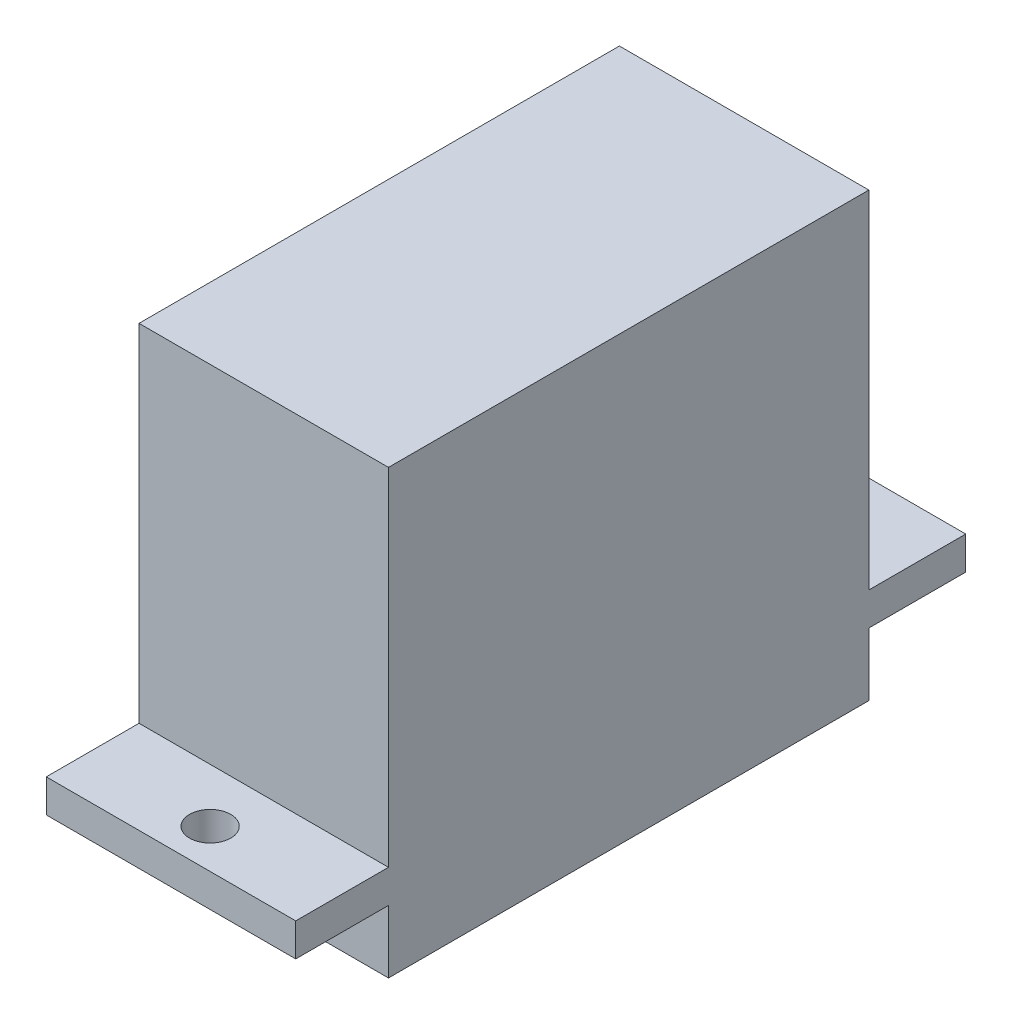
ISO-10303-21;
HEADER;
FILE_DESCRIPTION(('STEP AP214'),'2;1');
FILE_NAME('part.step','',(''),(''),'','','');
FILE_SCHEMA(('AUTOMOTIVE_DESIGN { 1 0 10303 214 1 1 1 1 }'));
ENDSEC;
DATA;
#1=APPLICATION_CONTEXT('core data for automotive mechanical design processes');
#2=APPLICATION_PROTOCOL_DEFINITION('international standard','automotive_design',2000,#1);
#3=PRODUCT_CONTEXT('',#1,'mechanical');
#4=PRODUCT('Part','Part','',(#3));
#5=PRODUCT_RELATED_PRODUCT_CATEGORY('part','',(#4));
#6=PRODUCT_DEFINITION_FORMATION('','',#4);
#7=PRODUCT_DEFINITION_CONTEXT('part definition',#1,'design');
#8=PRODUCT_DEFINITION('design','',#6,#7);
#9=PRODUCT_DEFINITION_SHAPE('','',#8);
#10=(LENGTH_UNIT() NAMED_UNIT(*) SI_UNIT(.MILLI.,.METRE.));
#11=(NAMED_UNIT(*) PLANE_ANGLE_UNIT() SI_UNIT($,.RADIAN.));
#12=(NAMED_UNIT(*) SI_UNIT($,.STERADIAN.) SOLID_ANGLE_UNIT());
#13=UNCERTAINTY_MEASURE_WITH_UNIT(LENGTH_MEASURE(1.E-05),#10,'distance_accuracy_value','');
#14=(GEOMETRIC_REPRESENTATION_CONTEXT(3) GLOBAL_UNCERTAINTY_ASSIGNED_CONTEXT((#13)) GLOBAL_UNIT_ASSIGNED_CONTEXT((#10,
#11,#12)) REPRESENTATION_CONTEXT('',''));
#15=CARTESIAN_POINT('',(0.,0.,0.));
#16=DIRECTION('',(0.,0.,1.));
#17=DIRECTION('',(1.,0.,0.));
#18=AXIS2_PLACEMENT_3D('',#15,#16,#17);
#19=CARTESIAN_POINT('',(6.05,-8.5159,16.8485));
#20=DIRECTION('',(0.,0.,-1.));
#21=DIRECTION('',(-1.,0.,0.));
#22=AXIS2_PLACEMENT_3D('',#19,#20,#21);
#23=PLANE('',#22);
#24=DIRECTION('',(-1.,0.,0.));
#25=VECTOR('',#24,1.);
#26=CARTESIAN_POINT('',(6.05,-5.46581,16.8485));
#27=LINE('',#26,#25);
#28=CARTESIAN_POINT('',(6.05,-5.46581,16.8485));
#29=VERTEX_POINT('',#28);
#30=CARTESIAN_POINT('',(-6.05,-5.46581,16.8485));
#31=VERTEX_POINT('',#30);
#32=EDGE_CURVE('E52',#29,#31,#27,.T.);
#33=ORIENTED_EDGE('',*,*,#32,.F.);
#34=DIRECTION('',(0.,-1.,0.));
#35=VECTOR('',#34,1.);
#36=CARTESIAN_POINT('',(6.05,-8.5159,16.8485));
#37=LINE('',#36,#35);
#38=CARTESIAN_POINT('',(6.05,-3.86581,16.8485));
#39=VERTEX_POINT('',#38);
#40=EDGE_CURVE('E167',#39,#29,#37,.T.);
#41=ORIENTED_EDGE('',*,*,#40,.F.);
#42=DIRECTION('',(-1.,0.,0.));
#43=VECTOR('',#42,1.);
#44=CARTESIAN_POINT('',(6.05,-3.86581,16.8485));
#45=LINE('',#44,#43);
#46=CARTESIAN_POINT('',(-6.05,-3.86581,16.8485));
#47=VERTEX_POINT('',#46);
#48=EDGE_CURVE('E225',#39,#47,#45,.T.);
#49=ORIENTED_EDGE('',*,*,#48,.T.);
#50=DIRECTION('',(0.,-1.,0.));
#51=VECTOR('',#50,1.);
#52=CARTESIAN_POINT('',(-6.05,-8.5159,16.8485));
#53=LINE('',#52,#51);
#54=EDGE_CURVE('E156',#47,#31,#53,.T.);
#55=ORIENTED_EDGE('',*,*,#54,.T.);
#56=EDGE_LOOP('',(#33,#41,#49,#55));
#57=FACE_BOUND('',#56,.T.);
#58=ADVANCED_FACE('F45',(#57),#23,.F.);
#59=CARTESIAN_POINT('',(6.05,-8.5159,-15.6515));
#60=DIRECTION('',(0.,0.,1.));
#61=DIRECTION('',(1.,0.,0.));
#62=AXIS2_PLACEMENT_3D('',#59,#60,#61);
#63=PLANE('',#62);
#64=DIRECTION('',(1.,0.,0.));
#65=VECTOR('',#64,1.);
#66=CARTESIAN_POINT('',(6.05,-5.46581,-15.6515));
#67=LINE('',#66,#65);
#68=CARTESIAN_POINT('',(-6.05,-5.46581,-15.6515));
#69=VERTEX_POINT('',#68);
#70=CARTESIAN_POINT('',(6.05,-5.46581,-15.6515));
#71=VERTEX_POINT('',#70);
#72=EDGE_CURVE('E170',#69,#71,#67,.T.);
#73=ORIENTED_EDGE('',*,*,#72,.F.);
#74=DIRECTION('',(0.,1.,0.));
#75=VECTOR('',#74,1.);
#76=CARTESIAN_POINT('',(-6.05,-8.5159,-15.6515));
#77=LINE('',#76,#75);
#78=CARTESIAN_POINT('',(-6.05,-3.86581,-15.6515));
#79=VERTEX_POINT('',#78);
#80=EDGE_CURVE('E155',#69,#79,#77,.T.);
#81=ORIENTED_EDGE('',*,*,#80,.T.);
#82=DIRECTION('',(1.,0.,0.));
#83=VECTOR('',#82,1.);
#84=CARTESIAN_POINT('',(6.05,-3.86581,-15.6515));
#85=LINE('',#84,#83);
#86=CARTESIAN_POINT('',(6.05,-3.86581,-15.6515));
#87=VERTEX_POINT('',#86);
#88=EDGE_CURVE('E161',#79,#87,#85,.T.);
#89=ORIENTED_EDGE('',*,*,#88,.T.);
#90=DIRECTION('',(0.,1.,0.));
#91=VECTOR('',#90,1.);
#92=CARTESIAN_POINT('',(6.05,-8.5159,-15.6515));
#93=LINE('',#92,#91);
#94=EDGE_CURVE('E246',#71,#87,#93,.T.);
#95=ORIENTED_EDGE('',*,*,#94,.F.);
#96=EDGE_LOOP('',(#73,#81,#89,#95));
#97=FACE_BOUND('',#96,.T.);
#98=ADVANCED_FACE('F291',(#97),#63,.F.);
#99=CARTESIAN_POINT('',(6.05,12.9341,16.8485));
#100=DIRECTION('',(0.,-1.,0.));
#101=DIRECTION('',(0.,0.,-1.));
#102=AXIS2_PLACEMENT_3D('',#99,#100,#101);
#103=PLANE('',#102);
#104=DIRECTION('',(1.,0.,0.));
#105=VECTOR('',#104,1.);
#106=CARTESIAN_POINT('',(-6.05,12.9341,-10.95155));
#107=LINE('',#106,#105);
#108=CARTESIAN_POINT('',(-6.05,12.9341,-10.95155));
#109=VERTEX_POINT('',#108);
#110=CARTESIAN_POINT('',(6.05,12.9341,-10.95155));
#111=VERTEX_POINT('',#110);
#112=EDGE_CURVE('E211',#109,#111,#107,.T.);
#113=ORIENTED_EDGE('',*,*,#112,.F.);
#114=DIRECTION('',(0.,0.,1.));
#115=VECTOR('',#114,1.);
#116=CARTESIAN_POINT('',(-6.05,12.9341,16.8485));
#117=LINE('',#116,#115);
#118=CARTESIAN_POINT('',(-6.05,12.9341,12.3484));
#119=VERTEX_POINT('',#118);
#120=EDGE_CURVE('E158',#109,#119,#117,.T.);
#121=ORIENTED_EDGE('',*,*,#120,.T.);
#122=DIRECTION('',(-1.,0.,0.));
#123=VECTOR('',#122,1.);
#124=CARTESIAN_POINT('',(-6.05,12.9341,12.3484));
#125=LINE('',#124,#123);
#126=CARTESIAN_POINT('',(6.05,12.9341,12.3484));
#127=VERTEX_POINT('',#126);
#128=EDGE_CURVE('E230',#127,#119,#125,.T.);
#129=ORIENTED_EDGE('',*,*,#128,.F.);
#130=DIRECTION('',(0.,0.,1.));
#131=VECTOR('',#130,1.);
#132=CARTESIAN_POINT('',(6.05,12.9341,16.8485));
#133=LINE('',#132,#131);
#134=EDGE_CURVE('E171',#111,#127,#133,.T.);
#135=ORIENTED_EDGE('',*,*,#134,.F.);
#136=EDGE_LOOP('',(#113,#121,#129,#135));
#137=FACE_BOUND('',#136,.T.);
#138=ADVANCED_FACE('F257',(#137),#103,.F.);
#139=CARTESIAN_POINT('',(6.05,0.,0.));
#140=DIRECTION('',(-1.,0.,0.));
#141=DIRECTION('',(0.,0.,1.));
#142=AXIS2_PLACEMENT_3D('',#139,#140,#141);
#143=PLANE('',#142);
#144=DIRECTION('',(0.,0.,-1.));
#145=VECTOR('',#144,1.);
#146=CARTESIAN_POINT('',(6.05,-8.5159,16.8485));
#147=LINE('',#146,#145);
#148=CARTESIAN_POINT('',(6.05,-8.5159,12.3484));
#149=VERTEX_POINT('',#148);
#150=CARTESIAN_POINT('',(6.05,-8.5159,-10.95155));
#151=VERTEX_POINT('',#150);
#152=EDGE_CURVE('E244',#149,#151,#147,.T.);
#153=ORIENTED_EDGE('',*,*,#152,.T.);
#154=DIRECTION('',(0.,1.,0.));
#155=VECTOR('',#154,1.);
#156=CARTESIAN_POINT('',(6.05,-8.5159,-10.95155));
#157=LINE('',#156,#155);
#158=CARTESIAN_POINT('',(6.05,-5.46581,-10.95155));
#159=VERTEX_POINT('',#158);
#160=EDGE_CURVE('E140',#151,#159,#157,.T.);
#161=ORIENTED_EDGE('',*,*,#160,.T.);
#162=DIRECTION('',(0.,0.,-1.));
#163=VECTOR('',#162,1.);
#164=CARTESIAN_POINT('',(6.05,-5.46581,-10.95155));
#165=LINE('',#164,#163);
#166=EDGE_CURVE('E145',#159,#71,#165,.T.);
#167=ORIENTED_EDGE('',*,*,#166,.T.);
#168=ORIENTED_EDGE('',*,*,#94,.T.);
#169=DIRECTION('',(0.,0.,-1.));
#170=VECTOR('',#169,1.);
#171=CARTESIAN_POINT('',(6.05,-3.86581,-10.95155));
#172=LINE('',#171,#170);
#173=CARTESIAN_POINT('',(6.05,-3.86581,-10.95155));
#174=VERTEX_POINT('',#173);
#175=EDGE_CURVE('E214',#174,#87,#172,.T.);
#176=ORIENTED_EDGE('',*,*,#175,.F.);
#177=DIRECTION('',(0.,-1.,0.));
#178=VECTOR('',#177,1.);
#179=CARTESIAN_POINT('',(6.05,12.9341,-10.95155));
#180=LINE('',#179,#178);
#181=EDGE_CURVE('E213',#111,#174,#180,.T.);
#182=ORIENTED_EDGE('',*,*,#181,.F.);
#183=ORIENTED_EDGE('',*,*,#134,.T.);
#184=DIRECTION('',(0.,-1.,0.));
#185=VECTOR('',#184,1.);
#186=CARTESIAN_POINT('',(6.05,12.9341,12.3484));
#187=LINE('',#186,#185);
#188=CARTESIAN_POINT('',(6.05,-3.86581,12.3484));
#189=VERTEX_POINT('',#188);
#190=EDGE_CURVE('E198',#127,#189,#187,.T.);
#191=ORIENTED_EDGE('',*,*,#190,.T.);
#192=DIRECTION('',(0.,0.,-1.));
#193=VECTOR('',#192,1.);
#194=CARTESIAN_POINT('',(6.05,-3.86581,16.9484));
#195=LINE('',#194,#193);
#196=EDGE_CURVE('E234',#39,#189,#195,.T.);
#197=ORIENTED_EDGE('',*,*,#196,.F.);
#198=ORIENTED_EDGE('',*,*,#40,.T.);
#199=DIRECTION('',(0.,0.,-1.));
#200=VECTOR('',#199,1.);
#201=CARTESIAN_POINT('',(6.05,-5.46581,16.9484));
#202=LINE('',#201,#200);
#203=CARTESIAN_POINT('',(6.05,-5.46581,12.3484));
#204=VERTEX_POINT('',#203);
#205=EDGE_CURVE('E205',#29,#204,#202,.T.);
#206=ORIENTED_EDGE('',*,*,#205,.T.);
#207=DIRECTION('',(0.,1.,0.));
#208=VECTOR('',#207,1.);
#209=CARTESIAN_POINT('',(6.05,-8.5159,12.3484));
#210=LINE('',#209,#208);
#211=EDGE_CURVE('E201',#149,#204,#210,.T.);
#212=ORIENTED_EDGE('',*,*,#211,.F.);
#213=EDGE_LOOP('',(#153,#161,#167,#168,#176,#182,#183,#191,#197,#198,#206,#212));
#214=FACE_BOUND('',#213,.T.);
#215=ADVANCED_FACE('F251',(#214),#143,.F.);
#216=CARTESIAN_POINT('',(-6.05,0.,0.));
#217=DIRECTION('',(-1.,0.,0.));
#218=DIRECTION('',(0.,0.,1.));
#219=AXIS2_PLACEMENT_3D('',#216,#217,#218);
#220=PLANE('',#219);
#221=DIRECTION('',(0.,1.,0.));
#222=VECTOR('',#221,1.);
#223=CARTESIAN_POINT('',(-6.05,-8.5159,-10.95155));
#224=LINE('',#223,#222);
#225=CARTESIAN_POINT('',(-6.05,-8.5159,-10.95155));
#226=VERTEX_POINT('',#225);
#227=CARTESIAN_POINT('',(-6.05,-5.46581,-10.95155));
#228=VERTEX_POINT('',#227);
#229=EDGE_CURVE('E138',#226,#228,#224,.T.);
#230=ORIENTED_EDGE('',*,*,#229,.F.);
#231=DIRECTION('',(0.,0.,-1.));
#232=VECTOR('',#231,1.);
#233=CARTESIAN_POINT('',(-6.05,-8.5159,16.8485));
#234=LINE('',#233,#232);
#235=CARTESIAN_POINT('',(-6.05,-8.5159,12.3484));
#236=VERTEX_POINT('',#235);
#237=EDGE_CURVE('E150',#236,#226,#234,.T.);
#238=ORIENTED_EDGE('',*,*,#237,.F.);
#239=DIRECTION('',(0.,1.,0.));
#240=VECTOR('',#239,1.);
#241=CARTESIAN_POINT('',(-6.05,-8.5159,12.3484));
#242=LINE('',#241,#240);
#243=CARTESIAN_POINT('',(-6.05,-5.46581,12.3484));
#244=VERTEX_POINT('',#243);
#245=EDGE_CURVE('E59',#236,#244,#242,.T.);
#246=ORIENTED_EDGE('',*,*,#245,.T.);
#247=DIRECTION('',(0.,0.,1.));
#248=VECTOR('',#247,1.);
#249=CARTESIAN_POINT('',(-6.05,-5.46581,16.9484));
#250=LINE('',#249,#248);
#251=EDGE_CURVE('E184',#244,#31,#250,.T.);
#252=ORIENTED_EDGE('',*,*,#251,.T.);
#253=ORIENTED_EDGE('',*,*,#54,.F.);
#254=DIRECTION('',(0.,0.,1.));
#255=VECTOR('',#254,1.);
#256=CARTESIAN_POINT('',(-6.05,-3.86581,16.9484));
#257=LINE('',#256,#255);
#258=CARTESIAN_POINT('',(-6.05,-3.86581,12.3484));
#259=VERTEX_POINT('',#258);
#260=EDGE_CURVE('E217',#259,#47,#257,.T.);
#261=ORIENTED_EDGE('',*,*,#260,.F.);
#262=DIRECTION('',(0.,-1.,0.));
#263=VECTOR('',#262,1.);
#264=CARTESIAN_POINT('',(-6.05,12.9341,12.3484));
#265=LINE('',#264,#263);
#266=EDGE_CURVE('E228',#119,#259,#265,.T.);
#267=ORIENTED_EDGE('',*,*,#266,.F.);
#268=ORIENTED_EDGE('',*,*,#120,.F.);
#269=DIRECTION('',(0.,-1.,0.));
#270=VECTOR('',#269,1.);
#271=CARTESIAN_POINT('',(-6.05,12.9341,-10.95155));
#272=LINE('',#271,#270);
#273=CARTESIAN_POINT('',(-6.05,-3.86581,-10.95155));
#274=VERTEX_POINT('',#273);
#275=EDGE_CURVE('E222',#109,#274,#272,.T.);
#276=ORIENTED_EDGE('',*,*,#275,.T.);
#277=DIRECTION('',(0.,0.,1.));
#278=VECTOR('',#277,1.);
#279=CARTESIAN_POINT('',(-6.05,-3.86581,0.));
#280=LINE('',#279,#278);
#281=EDGE_CURVE('E168',#79,#274,#280,.T.);
#282=ORIENTED_EDGE('',*,*,#281,.F.);
#283=ORIENTED_EDGE('',*,*,#80,.F.);
#284=DIRECTION('',(0.,0.,1.));
#285=VECTOR('',#284,1.);
#286=CARTESIAN_POINT('',(-6.05,-5.46581,-10.95155));
#287=LINE('',#286,#285);
#288=EDGE_CURVE('E67',#69,#228,#287,.T.);
#289=ORIENTED_EDGE('',*,*,#288,.T.);
#290=EDGE_LOOP('',(#230,#238,#246,#252,#253,#261,#267,#268,#276,#282,#283,#289));
#291=FACE_BOUND('',#290,.T.);
#292=ADVANCED_FACE('F149',(#291),#220,.T.);
#293=CARTESIAN_POINT('',(6.05,-8.5159,16.8485));
#294=DIRECTION('',(0.,1.,0.));
#295=DIRECTION('',(0.,0.,1.));
#296=AXIS2_PLACEMENT_3D('',#293,#294,#295);
#297=PLANE('',#296);
#298=CARTESIAN_POINT('',(0.,-8.5159,-7.64347991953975));
#299=DIRECTION('',(0.,1.,0.));
#300=DIRECTION('',(0.,0.,1.));
#301=AXIS2_PLACEMENT_3D('',#298,#299,#300);
#302=CIRCLE('',#301,1.55782141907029);
#303=CARTESIAN_POINT('',(0.,-8.5159,-6.08565850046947));
#304=VERTEX_POINT('',#303);
#305=EDGE_CURVE('E11',#304,#304,#302,.F.);
#306=ORIENTED_EDGE('',*,*,#305,.F.);
#307=EDGE_LOOP('',(#306));
#308=FACE_BOUND('',#307,.T.);
#309=ORIENTED_EDGE('',*,*,#237,.T.);
#310=DIRECTION('',(1.,0.,0.));
#311=VECTOR('',#310,1.);
#312=CARTESIAN_POINT('',(-6.05,-8.5159,-10.95155));
#313=LINE('',#312,#311);
#314=EDGE_CURVE('E134',#226,#151,#313,.T.);
#315=ORIENTED_EDGE('',*,*,#314,.T.);
#316=ORIENTED_EDGE('',*,*,#152,.F.);
#317=DIRECTION('',(-1.,0.,0.));
#318=VECTOR('',#317,1.);
#319=CARTESIAN_POINT('',(-6.05,-8.5159,12.3484));
#320=LINE('',#319,#318);
#321=EDGE_CURVE('E154',#149,#236,#320,.T.);
#322=ORIENTED_EDGE('',*,*,#321,.T.);
#323=EDGE_LOOP('',(#309,#315,#316,#322));
#324=FACE_BOUND('',#323,.T.);
#325=ADVANCED_FACE('F153',(#308,#324),#297,.F.);
#326=CARTESIAN_POINT('',(0.,-3.86581,0.));
#327=DIRECTION('',(0.,-1.,0.));
#328=DIRECTION('',(0.,0.,-1.));
#329=AXIS2_PLACEMENT_3D('',#326,#327,#328);
#330=PLANE('',#329);
#331=CARTESIAN_POINT('',(0.,-3.86581,14.9492386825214));
#332=DIRECTION('',(0.,-1.,0.));
#333=DIRECTION('',(0.,0.,-1.));
#334=AXIS2_PLACEMENT_3D('',#331,#332,#333);
#335=CIRCLE('',#334,1.);
#336=CARTESIAN_POINT('',(0.,-3.86581,13.9492386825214));
#337=VERTEX_POINT('',#336);
#338=EDGE_CURVE('E176',#337,#337,#335,.T.);
#339=ORIENTED_EDGE('',*,*,#338,.T.);
#340=EDGE_LOOP('',(#339));
#341=FACE_BOUND('',#340,.T.);
#342=ORIENTED_EDGE('',*,*,#196,.T.);
#343=DIRECTION('',(-1.,0.,0.));
#344=VECTOR('',#343,1.);
#345=CARTESIAN_POINT('',(-6.05,-3.86581,12.3484));
#346=LINE('',#345,#344);
#347=EDGE_CURVE('E231',#189,#259,#346,.T.);
#348=ORIENTED_EDGE('',*,*,#347,.T.);
#349=ORIENTED_EDGE('',*,*,#260,.T.);
#350=ORIENTED_EDGE('',*,*,#48,.F.);
#351=EDGE_LOOP('',(#342,#348,#349,#350));
#352=FACE_BOUND('',#351,.T.);
#353=ADVANCED_FACE('F266',(#341,#352),#330,.F.);
#354=CARTESIAN_POINT('',(-6.05,12.9341,12.3484));
#355=DIRECTION('',(0.,0.,1.));
#356=DIRECTION('',(1.,0.,0.));
#357=AXIS2_PLACEMENT_3D('',#354,#355,#356);
#358=PLANE('',#357);
#359=ORIENTED_EDGE('',*,*,#347,.F.);
#360=ORIENTED_EDGE('',*,*,#190,.F.);
#361=ORIENTED_EDGE('',*,*,#128,.T.);
#362=ORIENTED_EDGE('',*,*,#266,.T.);
#363=EDGE_LOOP('',(#359,#360,#361,#362));
#364=FACE_BOUND('',#363,.T.);
#365=ADVANCED_FACE('F262',(#364),#358,.T.);
#366=CARTESIAN_POINT('',(0.,-3.86581,0.));
#367=DIRECTION('',(0.,-1.,0.));
#368=DIRECTION('',(0.,0.,-1.));
#369=AXIS2_PLACEMENT_3D('',#366,#367,#368);
#370=PLANE('',#369);
#371=CARTESIAN_POINT('',(0.,-3.86581,-13.55));
#372=DIRECTION('',(0.,-1.,0.));
#373=DIRECTION('',(0.,0.,-1.));
#374=AXIS2_PLACEMENT_3D('',#371,#372,#373);
#375=CIRCLE('',#374,1.);
#376=CARTESIAN_POINT('',(0.,-3.86581,-14.55));
#377=VERTEX_POINT('',#376);
#378=EDGE_CURVE('E180',#377,#377,#375,.T.);
#379=ORIENTED_EDGE('',*,*,#378,.T.);
#380=EDGE_LOOP('',(#379));
#381=FACE_BOUND('',#380,.T.);
#382=ORIENTED_EDGE('',*,*,#281,.T.);
#383=DIRECTION('',(1.,0.,0.));
#384=VECTOR('',#383,1.);
#385=CARTESIAN_POINT('',(-6.05,-3.86581,-10.95155));
#386=LINE('',#385,#384);
#387=EDGE_CURVE('E215',#274,#174,#386,.T.);
#388=ORIENTED_EDGE('',*,*,#387,.T.);
#389=ORIENTED_EDGE('',*,*,#175,.T.);
#390=ORIENTED_EDGE('',*,*,#88,.F.);
#391=EDGE_LOOP('',(#382,#388,#389,#390));
#392=FACE_BOUND('',#391,.T.);
#393=ADVANCED_FACE('F388',(#381,#392),#370,.F.);
#394=CARTESIAN_POINT('',(-6.05,12.9341,-10.95155));
#395=DIRECTION('',(0.,0.,-1.));
#396=DIRECTION('',(-1.,0.,0.));
#397=AXIS2_PLACEMENT_3D('',#394,#395,#396);
#398=PLANE('',#397);
#399=ORIENTED_EDGE('',*,*,#387,.F.);
#400=ORIENTED_EDGE('',*,*,#275,.F.);
#401=ORIENTED_EDGE('',*,*,#112,.T.);
#402=ORIENTED_EDGE('',*,*,#181,.T.);
#403=EDGE_LOOP('',(#399,#400,#401,#402));
#404=FACE_BOUND('',#403,.T.);
#405=ADVANCED_FACE('F348',(#404),#398,.T.);
#406=CARTESIAN_POINT('',(0.,-5.46581,0.));
#407=DIRECTION('',(0.,-1.,0.));
#408=DIRECTION('',(0.,0.,-1.));
#409=AXIS2_PLACEMENT_3D('',#406,#407,#408);
#410=PLANE('',#409);
#411=CARTESIAN_POINT('',(0.,-5.46581,-13.55));
#412=DIRECTION('',(0.,-1.,0.));
#413=DIRECTION('',(0.,0.,-1.));
#414=AXIS2_PLACEMENT_3D('',#411,#412,#413);
#415=CIRCLE('',#414,1.);
#416=CARTESIAN_POINT('',(0.,-5.46581,-14.55));
#417=VERTEX_POINT('',#416);
#418=EDGE_CURVE('E178',#417,#417,#415,.T.);
#419=ORIENTED_EDGE('',*,*,#418,.F.);
#420=EDGE_LOOP('',(#419));
#421=FACE_BOUND('',#420,.T.);
#422=ORIENTED_EDGE('',*,*,#72,.T.);
#423=ORIENTED_EDGE('',*,*,#166,.F.);
#424=DIRECTION('',(1.,0.,0.));
#425=VECTOR('',#424,1.);
#426=CARTESIAN_POINT('',(-6.05,-5.46581,-10.95155));
#427=LINE('',#426,#425);
#428=EDGE_CURVE('E194',#228,#159,#427,.T.);
#429=ORIENTED_EDGE('',*,*,#428,.F.);
#430=ORIENTED_EDGE('',*,*,#288,.F.);
#431=EDGE_LOOP('',(#422,#423,#429,#430));
#432=FACE_BOUND('',#431,.T.);
#433=ADVANCED_FACE('F345',(#421,#432),#410,.T.);
#434=CARTESIAN_POINT('',(-6.05,-8.5159,-10.95155));
#435=DIRECTION('',(0.,0.,1.));
#436=DIRECTION('',(1.,0.,0.));
#437=AXIS2_PLACEMENT_3D('',#434,#435,#436);
#438=PLANE('',#437);
#439=ORIENTED_EDGE('',*,*,#428,.T.);
#440=ORIENTED_EDGE('',*,*,#160,.F.);
#441=ORIENTED_EDGE('',*,*,#314,.F.);
#442=ORIENTED_EDGE('',*,*,#229,.T.);
#443=EDGE_LOOP('',(#439,#440,#441,#442));
#444=FACE_BOUND('',#443,.T.);
#445=ADVANCED_FACE('F137',(#444),#438,.F.);
#446=CARTESIAN_POINT('',(0.,-5.46581,0.));
#447=DIRECTION('',(0.,-1.,0.));
#448=DIRECTION('',(0.,0.,-1.));
#449=AXIS2_PLACEMENT_3D('',#446,#447,#448);
#450=PLANE('',#449);
#451=CARTESIAN_POINT('',(0.,-5.46581,14.9492386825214));
#452=DIRECTION('',(0.,-1.,0.));
#453=DIRECTION('',(0.,0.,-1.));
#454=AXIS2_PLACEMENT_3D('',#451,#452,#453);
#455=CIRCLE('',#454,1.);
#456=CARTESIAN_POINT('',(0.,-5.46581,13.9492386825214));
#457=VERTEX_POINT('',#456);
#458=EDGE_CURVE('E174',#457,#457,#455,.T.);
#459=ORIENTED_EDGE('',*,*,#458,.F.);
#460=EDGE_LOOP('',(#459));
#461=FACE_BOUND('',#460,.T.);
#462=ORIENTED_EDGE('',*,*,#32,.T.);
#463=ORIENTED_EDGE('',*,*,#251,.F.);
#464=DIRECTION('',(-1.,0.,0.));
#465=VECTOR('',#464,1.);
#466=CARTESIAN_POINT('',(-6.05,-5.46581,12.3484));
#467=LINE('',#466,#465);
#468=EDGE_CURVE('E202',#204,#244,#467,.T.);
#469=ORIENTED_EDGE('',*,*,#468,.F.);
#470=ORIENTED_EDGE('',*,*,#205,.F.);
#471=EDGE_LOOP('',(#462,#463,#469,#470));
#472=FACE_BOUND('',#471,.T.);
#473=ADVANCED_FACE('F273',(#461,#472),#450,.T.);
#474=CARTESIAN_POINT('',(-6.05,-8.5159,12.3484));
#475=DIRECTION('',(0.,0.,-1.));
#476=DIRECTION('',(-1.,0.,0.));
#477=AXIS2_PLACEMENT_3D('',#474,#475,#476);
#478=PLANE('',#477);
#479=ORIENTED_EDGE('',*,*,#468,.T.);
#480=ORIENTED_EDGE('',*,*,#245,.F.);
#481=ORIENTED_EDGE('',*,*,#321,.F.);
#482=ORIENTED_EDGE('',*,*,#211,.T.);
#483=EDGE_LOOP('',(#479,#480,#481,#482));
#484=FACE_BOUND('',#483,.T.);
#485=ADVANCED_FACE('F274',(#484),#478,.F.);
#486=CARTESIAN_POINT('',(0.,-8.5159,14.9492386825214));
#487=DIRECTION('',(0.,1.,0.));
#488=DIRECTION('',(0.,0.,1.));
#489=AXIS2_PLACEMENT_3D('',#486,#487,#488);
#490=CYLINDRICAL_SURFACE('',#489,1.);
#491=ORIENTED_EDGE('',*,*,#458,.T.);
#492=EDGE_LOOP('',(#491));
#493=FACE_BOUND('',#492,.T.);
#494=ORIENTED_EDGE('',*,*,#338,.F.);
#495=EDGE_LOOP('',(#494));
#496=FACE_BOUND('',#495,.T.);
#497=ADVANCED_FACE('F276',(#493,#496),#490,.F.);
#498=CARTESIAN_POINT('',(0.,-8.5159,-13.55));
#499=DIRECTION('',(0.,1.,0.));
#500=DIRECTION('',(0.,0.,1.));
#501=AXIS2_PLACEMENT_3D('',#498,#499,#500);
#502=CYLINDRICAL_SURFACE('',#501,1.);
#503=ORIENTED_EDGE('',*,*,#418,.T.);
#504=EDGE_LOOP('',(#503));
#505=FACE_BOUND('',#504,.T.);
#506=ORIENTED_EDGE('',*,*,#378,.F.);
#507=EDGE_LOOP('',(#506));
#508=FACE_BOUND('',#507,.T.);
#509=ADVANCED_FACE('F283',(#505,#508),#502,.F.);
#510=CARTESIAN_POINT('',(0.,-11.5159,-7.64347991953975));
#511=DIRECTION('',(0.,-1.,0.));
#512=DIRECTION('',(0.,0.,-1.));
#513=AXIS2_PLACEMENT_3D('',#510,#511,#512);
#514=PLANE('',#513);
#515=CARTESIAN_POINT('',(0.,-11.5159,-7.64347991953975));
#516=DIRECTION('',(0.,-1.,0.));
#517=DIRECTION('',(0.,0.,-1.));
#518=AXIS2_PLACEMENT_3D('',#515,#516,#517);
#519=CIRCLE('',#518,1.55782141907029);
#520=CARTESIAN_POINT('',(0.,-11.5159,-9.20130133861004));
#521=VERTEX_POINT('',#520);
#522=EDGE_CURVE('E177',#521,#521,#519,.T.);
#523=ORIENTED_EDGE('',*,*,#522,.T.);
#524=EDGE_LOOP('',(#523));
#525=FACE_BOUND('',#524,.T.);
#526=CARTESIAN_POINT('',(0.,-11.5159,-7.64347991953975));
#527=DIRECTION('',(0.,-1.,0.));
#528=DIRECTION('',(0.,0.,-1.));
#529=AXIS2_PLACEMENT_3D('',#526,#527,#528);
#530=CIRCLE('',#529,1.0490327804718);
#531=CARTESIAN_POINT('',(0.,-11.5159,-8.69251270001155));
#532=VERTEX_POINT('',#531);
#533=EDGE_CURVE('E327',#532,#532,#530,.T.);
#534=ORIENTED_EDGE('',*,*,#533,.F.);
#535=EDGE_LOOP('',(#534));
#536=FACE_BOUND('',#535,.T.);
#537=ADVANCED_FACE('F334',(#525,#536),#514,.T.);
#538=CARTESIAN_POINT('',(0.,-11.5159,-7.64347991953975));
#539=DIRECTION('',(0.,1.,0.));
#540=DIRECTION('',(0.,0.,1.));
#541=AXIS2_PLACEMENT_3D('',#538,#539,#540);
#542=CYLINDRICAL_SURFACE('',#541,1.55782141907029);
#543=ORIENTED_EDGE('',*,*,#522,.F.);
#544=EDGE_LOOP('',(#543));
#545=FACE_BOUND('',#544,.T.);
#546=ORIENTED_EDGE('',*,*,#305,.T.);
#547=EDGE_LOOP('',(#546));
#548=FACE_BOUND('',#547,.T.);
#549=ADVANCED_FACE('F320',(#545,#548),#542,.T.);
#550=CARTESIAN_POINT('',(0.,-11.5159,-7.64347991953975));
#551=DIRECTION('',(0.,1.,0.));
#552=DIRECTION('',(0.,0.,1.));
#553=AXIS2_PLACEMENT_3D('',#550,#551,#552);
#554=CYLINDRICAL_SURFACE('',#553,1.0490327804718);
#555=ORIENTED_EDGE('',*,*,#533,.T.);
#556=EDGE_LOOP('',(#555));
#557=FACE_BOUND('',#556,.T.);
#558=CARTESIAN_POINT('',(0.,-8.5159,-7.64347991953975));
#559=DIRECTION('',(0.,-1.,0.));
#560=DIRECTION('',(0.,0.,-1.));
#561=AXIS2_PLACEMENT_3D('',#558,#559,#560);
#562=CIRCLE('',#561,1.0490327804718);
#563=CARTESIAN_POINT('',(0.,-8.5159,-8.69251270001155));
#564=VERTEX_POINT('',#563);
#565=EDGE_CURVE('E325',#564,#564,#562,.T.);
#566=ORIENTED_EDGE('',*,*,#565,.F.);
#567=EDGE_LOOP('',(#566));
#568=FACE_BOUND('',#567,.T.);
#569=ADVANCED_FACE('F315',(#557,#568),#554,.F.);
#570=ORIENTED_EDGE('',*,*,#565,.T.);
#571=EDGE_LOOP('',(#570));
#572=FACE_BOUND('',#571,.T.);
#573=ADVANCED_FACE('F306',(#572),#297,.F.);
#574=CLOSED_SHELL('',(#58,#98,#138,#215,#292,#325,#353,#365,#393,#405,#433,#445,#473,#485,#497,
#509,#537,#549,#569,#573));
#575=MANIFOLD_SOLID_BREP('B2',#574);
#576=ADVANCED_BREP_SHAPE_REPRESENTATION('',(#18,#575),#14);
#577=SHAPE_DEFINITION_REPRESENTATION(#9,#576);
ENDSEC;
END-ISO-10303-21;
